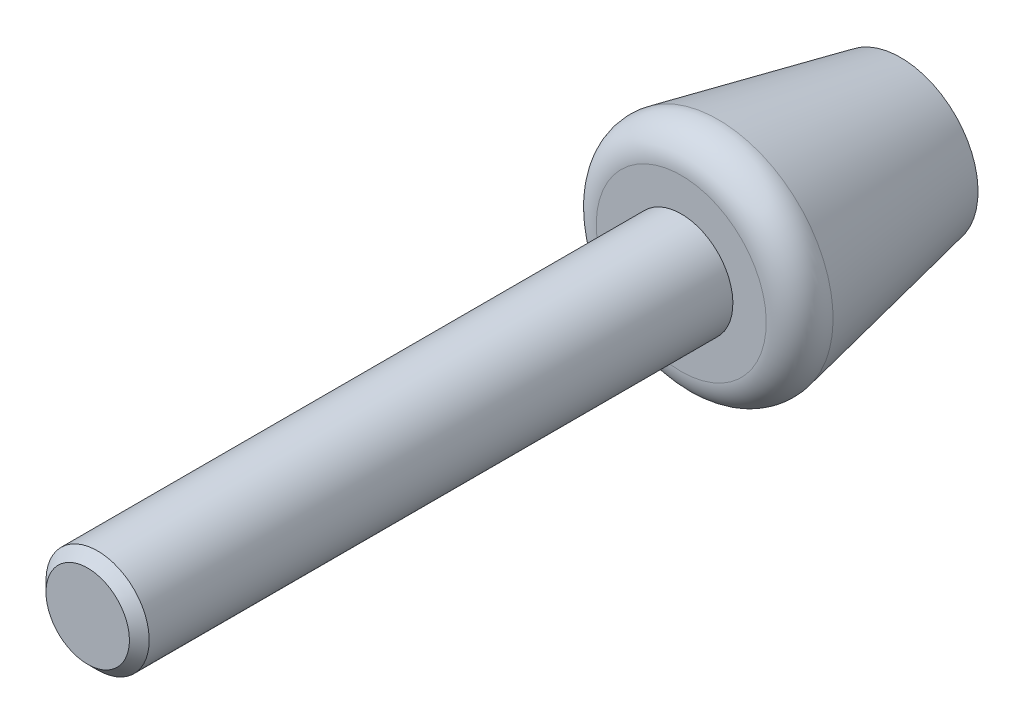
ISO-10303-21;
HEADER;
FILE_DESCRIPTION(('STEP AP214'),'2;1');
FILE_NAME('part.step','',(''),(''),'','','');
FILE_SCHEMA(('AUTOMOTIVE_DESIGN { 1 0 10303 214 1 1 1 1 }'));
ENDSEC;
DATA;
#1=APPLICATION_CONTEXT('core data for automotive mechanical design processes');
#2=APPLICATION_PROTOCOL_DEFINITION('international standard','automotive_design',2000,#1);
#3=PRODUCT_CONTEXT('',#1,'mechanical');
#4=PRODUCT('Part','Part','',(#3));
#5=PRODUCT_RELATED_PRODUCT_CATEGORY('part','',(#4));
#6=PRODUCT_DEFINITION_FORMATION('','',#4);
#7=PRODUCT_DEFINITION_CONTEXT('part definition',#1,'design');
#8=PRODUCT_DEFINITION('design','',#6,#7);
#9=PRODUCT_DEFINITION_SHAPE('','',#8);
#10=(LENGTH_UNIT() NAMED_UNIT(*) SI_UNIT(.MILLI.,.METRE.));
#11=(NAMED_UNIT(*) PLANE_ANGLE_UNIT() SI_UNIT($,.RADIAN.));
#12=(NAMED_UNIT(*) SI_UNIT($,.STERADIAN.) SOLID_ANGLE_UNIT());
#13=UNCERTAINTY_MEASURE_WITH_UNIT(LENGTH_MEASURE(1.E-05),#10,'distance_accuracy_value','');
#14=(GEOMETRIC_REPRESENTATION_CONTEXT(3) GLOBAL_UNCERTAINTY_ASSIGNED_CONTEXT((#13)) GLOBAL_UNIT_ASSIGNED_CONTEXT((#10,
#11,#12)) REPRESENTATION_CONTEXT('',''));
#15=CARTESIAN_POINT('',(0.,0.,0.));
#16=DIRECTION('',(0.,0.,1.));
#17=DIRECTION('',(1.,0.,0.));
#18=AXIS2_PLACEMENT_3D('',#15,#16,#17);
#19=CARTESIAN_POINT('',(0.,0.,63.));
#20=DIRECTION('',(0.,0.,1.));
#21=DIRECTION('',(0.,-1.,0.));
#22=AXIS2_PLACEMENT_3D('',#19,#20,#21);
#23=PLANE('',#22);
#24=CARTESIAN_POINT('',(0.,0.,63.));
#25=DIRECTION('',(0.,0.,1.));
#26=DIRECTION('',(0.,-1.,0.));
#27=AXIS2_PLACEMENT_3D('',#24,#25,#26);
#28=CIRCLE('',#27,3.233);
#29=CARTESIAN_POINT('',(0.,-3.233,63.));
#30=VERTEX_POINT('',#29);
#31=EDGE_CURVE('E8',#30,#30,#28,.T.);
#32=ORIENTED_EDGE('',*,*,#31,.T.);
#33=EDGE_LOOP('',(#32));
#34=FACE_BOUND('',#33,.T.);
#35=ADVANCED_FACE('F13',(#34),#23,.T.);
#36=CARTESIAN_POINT('',(0.,0.,63.));
#37=DIRECTION('',(0.,0.,-1.));
#38=DIRECTION('',(0.,1.,0.));
#39=AXIS2_PLACEMENT_3D('',#36,#37,#38);
#40=CONICAL_SURFACE('',#39,3.233,0.785398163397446);
#41=CARTESIAN_POINT('',(0.,0.,62.233));
#42=DIRECTION('',(0.,0.,1.));
#43=DIRECTION('',(0.,-1.,0.));
#44=AXIS2_PLACEMENT_3D('',#41,#42,#43);
#45=CIRCLE('',#44,4.);
#46=CARTESIAN_POINT('',(0.,-4.,62.233));
#47=VERTEX_POINT('',#46);
#48=EDGE_CURVE('E19',#47,#47,#45,.T.);
#49=ORIENTED_EDGE('',*,*,#48,.T.);
#50=EDGE_LOOP('',(#49));
#51=FACE_BOUND('',#50,.T.);
#52=ORIENTED_EDGE('',*,*,#31,.F.);
#53=EDGE_LOOP('',(#52));
#54=FACE_BOUND('',#53,.T.);
#55=ADVANCED_FACE('F53',(#51,#54),#40,.T.);
#56=CARTESIAN_POINT('',(0.,0.,0.));
#57=DIRECTION('',(0.,0.,1.));
#58=DIRECTION('',(0.,-1.,0.));
#59=AXIS2_PLACEMENT_3D('',#56,#57,#58);
#60=CYLINDRICAL_SURFACE('',#59,4.);
#61=CARTESIAN_POINT('',(0.,0.,17.));
#62=DIRECTION('',(0.,0.,1.));
#63=DIRECTION('',(0.,-1.,0.));
#64=AXIS2_PLACEMENT_3D('',#61,#62,#63);
#65=CIRCLE('',#64,4.);
#66=CARTESIAN_POINT('',(0.,-4.,17.));
#67=VERTEX_POINT('',#66);
#68=EDGE_CURVE('E23',#67,#67,#65,.T.);
#69=ORIENTED_EDGE('',*,*,#68,.T.);
#70=EDGE_LOOP('',(#69));
#71=FACE_BOUND('',#70,.T.);
#72=ORIENTED_EDGE('',*,*,#48,.F.);
#73=EDGE_LOOP('',(#72));
#74=FACE_BOUND('',#73,.T.);
#75=ADVANCED_FACE('F58',(#71,#74),#60,.T.);
#76=CARTESIAN_POINT('',(4.,0.,17.));
#77=DIRECTION('',(0.,0.,1.));
#78=DIRECTION('',(0.,-1.,0.));
#79=AXIS2_PLACEMENT_3D('',#76,#77,#78);
#80=PLANE('',#79);
#81=CARTESIAN_POINT('',(0.,0.,17.));
#82=DIRECTION('',(0.,0.,1.));
#83=DIRECTION('',(0.,-1.,0.));
#84=AXIS2_PLACEMENT_3D('',#81,#82,#83);
#85=CIRCLE('',#84,6.5862165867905);
#86=CARTESIAN_POINT('',(0.,-6.5862165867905,17.));
#87=VERTEX_POINT('',#86);
#88=EDGE_CURVE('E27',#87,#87,#85,.T.);
#89=ORIENTED_EDGE('',*,*,#88,.T.);
#90=EDGE_LOOP('',(#89));
#91=FACE_BOUND('',#90,.T.);
#92=ORIENTED_EDGE('',*,*,#68,.F.);
#93=EDGE_LOOP('',(#92));
#94=FACE_BOUND('',#93,.T.);
#95=ADVANCED_FACE('F63',(#91,#94),#80,.T.);
#96=CARTESIAN_POINT('',(0.,0.,14.625));
#97=DIRECTION('',(0.,0.,1.));
#98=DIRECTION('',(0.,-1.,0.));
#99=AXIS2_PLACEMENT_3D('',#96,#97,#98);
#100=TOROIDAL_SURFACE('',#99,6.58621658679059,2.37499999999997);
#101=CARTESIAN_POINT('',(0.,0.,14.1460743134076));
#102=DIRECTION('',(0.,0.,1.));
#103=DIRECTION('',(0.,-1.,0.));
#104=AXIS2_PLACEMENT_3D('',#101,#102,#103);
#105=CIRCLE('',#104,8.9124270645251);
#106=CARTESIAN_POINT('',(0.,-8.9124270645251,14.1460743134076));
#107=VERTEX_POINT('',#106);
#108=EDGE_CURVE('E32',#107,#107,#105,.T.);
#109=ORIENTED_EDGE('',*,*,#108,.T.);
#110=EDGE_LOOP('',(#109));
#111=FACE_BOUND('',#110,.T.);
#112=ORIENTED_EDGE('',*,*,#88,.F.);
#113=EDGE_LOOP('',(#112));
#114=FACE_BOUND('',#113,.T.);
#115=ADVANCED_FACE('F50',(#111,#114),#100,.T.);
#116=CARTESIAN_POINT('',(0.,0.,14.1460743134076));
#117=DIRECTION('',(0.,0.,1.));
#118=DIRECTION('',(0.,-1.,0.));
#119=AXIS2_PLACEMENT_3D('',#116,#117,#118);
#120=CONICAL_SURFACE('',#119,8.9124270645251,0.203045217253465);
#121=CARTESIAN_POINT('',(0.,0.,0.));
#122=DIRECTION('',(0.,0.,1.));
#123=DIRECTION('',(0.,-1.,0.));
#124=AXIS2_PLACEMENT_3D('',#121,#122,#123);
#125=CIRCLE('',#124,6.);
#126=CARTESIAN_POINT('',(0.,-6.,0.));
#127=VERTEX_POINT('',#126);
#128=EDGE_CURVE('E35',#127,#127,#125,.T.);
#129=ORIENTED_EDGE('',*,*,#128,.T.);
#130=EDGE_LOOP('',(#129));
#131=FACE_BOUND('',#130,.T.);
#132=ORIENTED_EDGE('',*,*,#108,.F.);
#133=EDGE_LOOP('',(#132));
#134=FACE_BOUND('',#133,.T.);
#135=ADVANCED_FACE('F39',(#131,#134),#120,.T.);
#136=CARTESIAN_POINT('',(6.,0.,0.));
#137=DIRECTION('',(0.,0.,-1.));
#138=DIRECTION('',(0.,1.,0.));
#139=AXIS2_PLACEMENT_3D('',#136,#137,#138);
#140=PLANE('',#139);
#141=ORIENTED_EDGE('',*,*,#128,.F.);
#142=EDGE_LOOP('',(#141));
#143=FACE_BOUND('',#142,.T.);
#144=ADVANCED_FACE('F42',(#143),#140,.T.);
#145=CLOSED_SHELL('',(#35,#55,#75,#95,#115,#135,#144));
#146=MANIFOLD_SOLID_BREP('B1',#145);
#147=ADVANCED_BREP_SHAPE_REPRESENTATION('',(#18,#146),#14);
#148=SHAPE_DEFINITION_REPRESENTATION(#9,#147);
ENDSEC;
END-ISO-10303-21;
